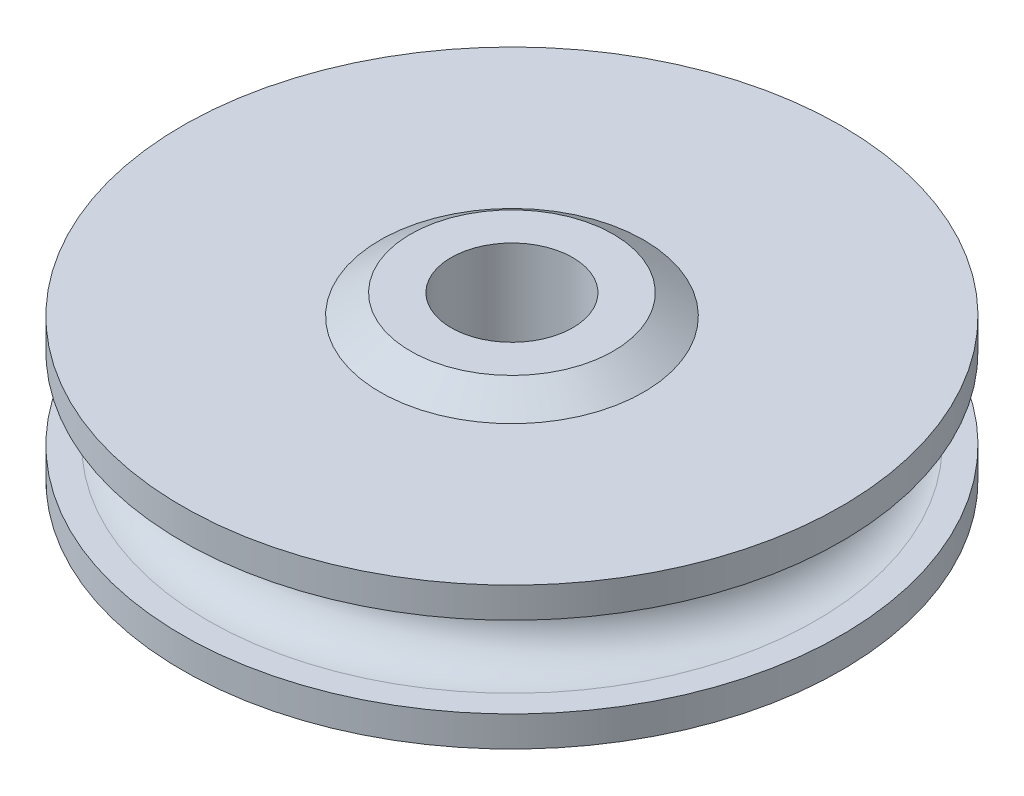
from build123d import *


with BuildPart() as part:
    # Esquisse1 → R_volution1 (revolve)
    with BuildSketch(Plane.XY, mode=Mode.PRIVATE) as r_volution1_sk:
        with BuildLine():
            Line((13, -7), (32.5, -7))
            Line((32.5, -7), (32.5, -4))
            Line((32.5, -4), (30, -4))
            ThreePointArc((30, -4), (26, 0), (30, 4))
            Line((30, 4), (32.5, 4))
            Line((32.5, 4), (32.5, 7))
            Line((32.5, 7), (13, 7))
            Line((13, 7), (10, 9))
            Line((10, 9), (6, 9))
            Line((6, 9), (6, -9))
            Line((6, -9), (10, -9))
            Line((10, -9), (13, -7))
        make_face()
    revolve(r_volution1_sk.sketch.rotate(Axis((0, 9, 0), (0, -1, 0)), 270), axis=Axis((0, 9, 0), (0, -1, 0)))


solid = part.part
